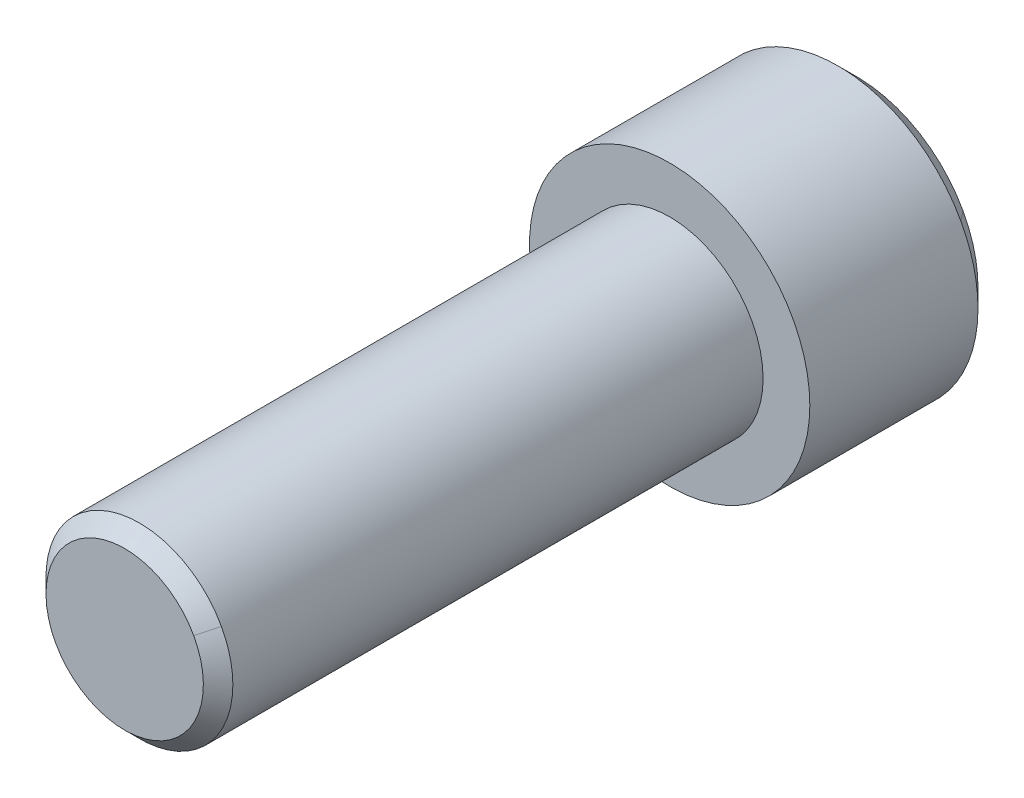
ISO-10303-21;
HEADER;
FILE_DESCRIPTION(('STEP AP214'),'2;1');
FILE_NAME('part.step','',(''),(''),'','','');
FILE_SCHEMA(('AUTOMOTIVE_DESIGN { 1 0 10303 214 1 1 1 1 }'));
ENDSEC;
DATA;
#1=APPLICATION_CONTEXT('core data for automotive mechanical design processes');
#2=APPLICATION_PROTOCOL_DEFINITION('international standard','automotive_design',2000,#1);
#3=PRODUCT_CONTEXT('',#1,'mechanical');
#4=PRODUCT('Part','Part','',(#3));
#5=PRODUCT_RELATED_PRODUCT_CATEGORY('part','',(#4));
#6=PRODUCT_DEFINITION_FORMATION('','',#4);
#7=PRODUCT_DEFINITION_CONTEXT('part definition',#1,'design');
#8=PRODUCT_DEFINITION('design','',#6,#7);
#9=PRODUCT_DEFINITION_SHAPE('','',#8);
#10=(LENGTH_UNIT() NAMED_UNIT(*) SI_UNIT(.MILLI.,.METRE.));
#11=(NAMED_UNIT(*) PLANE_ANGLE_UNIT() SI_UNIT($,.RADIAN.));
#12=(NAMED_UNIT(*) SI_UNIT($,.STERADIAN.) SOLID_ANGLE_UNIT());
#13=UNCERTAINTY_MEASURE_WITH_UNIT(LENGTH_MEASURE(1.E-05),#10,'distance_accuracy_value','');
#14=(GEOMETRIC_REPRESENTATION_CONTEXT(3) GLOBAL_UNCERTAINTY_ASSIGNED_CONTEXT((#13)) GLOBAL_UNIT_ASSIGNED_CONTEXT((#10,
#11,#12)) REPRESENTATION_CONTEXT('',''));
#15=CARTESIAN_POINT('',(0.,0.,0.));
#16=DIRECTION('',(0.,0.,1.));
#17=DIRECTION('',(1.,0.,0.));
#18=AXIS2_PLACEMENT_3D('',#15,#16,#17);
#19=CARTESIAN_POINT('',(0.,0.,6.00000000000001));
#20=DIRECTION('',(0.,0.,-1.));
#21=DIRECTION('',(-1.,0.,0.));
#22=AXIS2_PLACEMENT_3D('',#19,#20,#21);
#23=PLANE('',#22);
#24=DIRECTION('',(0.50000000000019,-0.866025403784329,0.));
#25=VECTOR('',#24,1.);
#26=CARTESIAN_POINT('',(2.88675134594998,5.,6.00000000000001));
#27=LINE('',#26,#25);
#28=CARTESIAN_POINT('',(5.77350269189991,0.,6.00000000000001));
#29=VERTEX_POINT('',#28);
#30=CARTESIAN_POINT('',(2.88675134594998,5.,6.00000000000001));
#31=VERTEX_POINT('',#30);
#32=EDGE_CURVE('E111',#29,#31,#27,.F.);
#33=ORIENTED_EDGE('',*,*,#32,.F.);
#34=DIRECTION('',(-0.50000000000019,-0.866025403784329,0.));
#35=VECTOR('',#34,1.);
#36=CARTESIAN_POINT('',(5.77350269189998,0.,6.00000000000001));
#37=LINE('',#36,#35);
#38=CARTESIAN_POINT('',(2.88675134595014,-5.0000000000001,6.00000000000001));
#39=VERTEX_POINT('',#38);
#40=EDGE_CURVE('E92',#39,#29,#37,.F.);
#41=ORIENTED_EDGE('',*,*,#40,.F.);
#42=DIRECTION('',(-1.,0.,0.));
#43=VECTOR('',#42,1.);
#44=CARTESIAN_POINT('',(2.88675134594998,-5.00000000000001,6.00000000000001));
#45=LINE('',#44,#43);
#46=CARTESIAN_POINT('',(-2.88675134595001,-5.00000000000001,6.00000000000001));
#47=VERTEX_POINT('',#46);
#48=EDGE_CURVE('E108',#47,#39,#45,.F.);
#49=ORIENTED_EDGE('',*,*,#48,.F.);
#50=DIRECTION('',(-0.50000000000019,0.866025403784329,0.));
#51=VECTOR('',#50,1.);
#52=CARTESIAN_POINT('',(-2.88675134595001,-5.00000000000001,6.00000000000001));
#53=LINE('',#52,#51);
#54=CARTESIAN_POINT('',(-5.77350269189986,0.,6.00000000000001));
#55=VERTEX_POINT('',#54);
#56=EDGE_CURVE('E126',#55,#47,#53,.F.);
#57=ORIENTED_EDGE('',*,*,#56,.F.);
#58=DIRECTION('',(0.50000000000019,0.866025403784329,0.));
#59=VECTOR('',#58,1.);
#60=CARTESIAN_POINT('',(-5.77350269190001,0.,6.00000000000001));
#61=LINE('',#60,#59);
#62=CARTESIAN_POINT('',(-2.88675134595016,5.00000000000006,6.00000000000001));
#63=VERTEX_POINT('',#62);
#64=EDGE_CURVE('E131',#63,#55,#61,.F.);
#65=ORIENTED_EDGE('',*,*,#64,.F.);
#66=DIRECTION('',(1.,0.,0.));
#67=VECTOR('',#66,1.);
#68=CARTESIAN_POINT('',(-2.88675134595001,4.99999999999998,6.00000000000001));
#69=LINE('',#68,#67);
#70=EDGE_CURVE('E137',#31,#63,#69,.F.);
#71=ORIENTED_EDGE('',*,*,#70,.F.);
#72=EDGE_LOOP('',(#33,#41,#49,#57,#65,#71));
#73=FACE_BOUND('',#72,.T.);
#74=ADVANCED_FACE('F16',(#73),#23,.T.);
#75=CARTESIAN_POINT('',(5.77350269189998,0.,0.));
#76=DIRECTION('',(-0.866025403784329,0.50000000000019,0.));
#77=DIRECTION('',(-0.50000000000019,-0.866025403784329,0.));
#78=AXIS2_PLACEMENT_3D('',#75,#76,#77);
#79=PLANE('',#78);
#80=DIRECTION('',(0.,0.,1.));
#81=VECTOR('',#80,1.);
#82=CARTESIAN_POINT('',(2.88675134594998,-5.00000000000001,0.));
#83=LINE('',#82,#81);
#84=CARTESIAN_POINT('',(2.88675134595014,-5.0000000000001,0.));
#85=VERTEX_POINT('',#84);
#86=EDGE_CURVE('E112',#39,#85,#83,.F.);
#87=ORIENTED_EDGE('',*,*,#86,.F.);
#88=ORIENTED_EDGE('',*,*,#40,.T.);
#89=DIRECTION('',(0.,0.,1.));
#90=VECTOR('',#89,1.);
#91=CARTESIAN_POINT('',(5.77350269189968,-1.80411241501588E-13,0.));
#92=LINE('',#91,#90);
#93=CARTESIAN_POINT('',(5.77350269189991,0.,0.));
#94=VERTEX_POINT('',#93);
#95=EDGE_CURVE('E88',#94,#29,#92,.T.);
#96=ORIENTED_EDGE('',*,*,#95,.F.);
#97=DIRECTION('',(-0.500000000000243,-0.866025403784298,0.));
#98=VECTOR('',#97,1.);
#99=CARTESIAN_POINT('',(5.77350269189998,0.,0.));
#100=LINE('',#99,#98);
#101=EDGE_CURVE('E117',#94,#85,#100,.T.);
#102=ORIENTED_EDGE('',*,*,#101,.T.);
#103=EDGE_LOOP('',(#87,#88,#96,#102));
#104=FACE_BOUND('',#103,.T.);
#105=ADVANCED_FACE('F115',(#104),#79,.T.);
#106=CARTESIAN_POINT('',(2.88675134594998,-5.00000000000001,0.));
#107=DIRECTION('',(0.,1.,0.));
#108=DIRECTION('',(-1.,0.,0.));
#109=AXIS2_PLACEMENT_3D('',#106,#107,#108);
#110=PLANE('',#109);
#111=DIRECTION('',(0.,0.,1.));
#112=VECTOR('',#111,1.);
#113=CARTESIAN_POINT('',(-2.88675134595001,-5.00000000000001,0.));
#114=LINE('',#113,#112);
#115=CARTESIAN_POINT('',(-2.88675134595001,-5.00000000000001,0.));
#116=VERTEX_POINT('',#115);
#117=EDGE_CURVE('E123',#47,#116,#114,.F.);
#118=ORIENTED_EDGE('',*,*,#117,.F.);
#119=ORIENTED_EDGE('',*,*,#48,.T.);
#120=ORIENTED_EDGE('',*,*,#86,.T.);
#121=DIRECTION('',(1.,0.,0.));
#122=VECTOR('',#121,1.);
#123=CARTESIAN_POINT('',(0.,-5.00000000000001,0.));
#124=LINE('',#123,#122);
#125=EDGE_CURVE('E152',#85,#116,#124,.F.);
#126=ORIENTED_EDGE('',*,*,#125,.T.);
#127=EDGE_LOOP('',(#118,#119,#120,#126));
#128=FACE_BOUND('',#127,.T.);
#129=ADVANCED_FACE('F121',(#128),#110,.T.);
#130=CARTESIAN_POINT('',(-2.88675134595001,-5.00000000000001,0.));
#131=DIRECTION('',(0.866025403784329,0.50000000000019,0.));
#132=DIRECTION('',(-0.50000000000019,0.866025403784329,0.));
#133=AXIS2_PLACEMENT_3D('',#130,#131,#132);
#134=PLANE('',#133);
#135=DIRECTION('',(0.,0.,1.));
#136=VECTOR('',#135,1.);
#137=CARTESIAN_POINT('',(-5.77350269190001,0.,0.));
#138=LINE('',#137,#136);
#139=CARTESIAN_POINT('',(-5.77350269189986,0.,0.));
#140=VERTEX_POINT('',#139);
#141=EDGE_CURVE('E129',#55,#140,#138,.F.);
#142=ORIENTED_EDGE('',*,*,#141,.F.);
#143=ORIENTED_EDGE('',*,*,#56,.T.);
#144=ORIENTED_EDGE('',*,*,#117,.T.);
#145=DIRECTION('',(-0.500000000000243,0.866025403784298,0.));
#146=VECTOR('',#145,1.);
#147=CARTESIAN_POINT('',(-2.88675134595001,-5.00000000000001,0.));
#148=LINE('',#147,#146);
#149=EDGE_CURVE('E150',#116,#140,#148,.T.);
#150=ORIENTED_EDGE('',*,*,#149,.T.);
#151=EDGE_LOOP('',(#142,#143,#144,#150));
#152=FACE_BOUND('',#151,.T.);
#153=ADVANCED_FACE('F273',(#152),#134,.T.);
#154=CARTESIAN_POINT('',(-5.77350269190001,0.,0.));
#155=DIRECTION('',(0.866025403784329,-0.50000000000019,0.));
#156=DIRECTION('',(0.50000000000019,0.866025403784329,0.));
#157=AXIS2_PLACEMENT_3D('',#154,#155,#156);
#158=PLANE('',#157);
#159=DIRECTION('',(0.,0.,-1.));
#160=VECTOR('',#159,1.);
#161=CARTESIAN_POINT('',(-2.88675134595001,4.99999999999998,0.));
#162=LINE('',#161,#160);
#163=CARTESIAN_POINT('',(-2.88675134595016,5.00000000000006,0.));
#164=VERTEX_POINT('',#163);
#165=EDGE_CURVE('E134',#63,#164,#162,.T.);
#166=ORIENTED_EDGE('',*,*,#165,.F.);
#167=ORIENTED_EDGE('',*,*,#64,.T.);
#168=ORIENTED_EDGE('',*,*,#141,.T.);
#169=DIRECTION('',(0.500000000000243,0.866025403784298,0.));
#170=VECTOR('',#169,1.);
#171=CARTESIAN_POINT('',(-5.77350269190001,0.,0.));
#172=LINE('',#171,#170);
#173=EDGE_CURVE('E148',#140,#164,#172,.T.);
#174=ORIENTED_EDGE('',*,*,#173,.T.);
#175=EDGE_LOOP('',(#166,#167,#168,#174));
#176=FACE_BOUND('',#175,.T.);
#177=ADVANCED_FACE('F270',(#176),#158,.T.);
#178=CARTESIAN_POINT('',(-2.88675134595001,4.99999999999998,0.));
#179=DIRECTION('',(0.,-1.,0.));
#180=DIRECTION('',(0.,0.,-1.));
#181=AXIS2_PLACEMENT_3D('',#178,#179,#180);
#182=PLANE('',#181);
#183=DIRECTION('',(0.,0.,1.));
#184=VECTOR('',#183,1.);
#185=CARTESIAN_POINT('',(2.88675134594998,5.,0.));
#186=LINE('',#185,#184);
#187=CARTESIAN_POINT('',(2.88675134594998,5.,0.));
#188=VERTEX_POINT('',#187);
#189=EDGE_CURVE('E140',#31,#188,#186,.F.);
#190=ORIENTED_EDGE('',*,*,#189,.F.);
#191=ORIENTED_EDGE('',*,*,#70,.T.);
#192=ORIENTED_EDGE('',*,*,#165,.T.);
#193=DIRECTION('',(1.,0.,0.));
#194=VECTOR('',#193,1.);
#195=CARTESIAN_POINT('',(0.,5.,0.));
#196=LINE('',#195,#194);
#197=EDGE_CURVE('E68',#164,#188,#196,.T.);
#198=ORIENTED_EDGE('',*,*,#197,.T.);
#199=EDGE_LOOP('',(#190,#191,#192,#198));
#200=FACE_BOUND('',#199,.T.);
#201=ADVANCED_FACE('F264',(#200),#182,.T.);
#202=CARTESIAN_POINT('',(2.88675134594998,5.,0.));
#203=DIRECTION('',(-0.866025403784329,-0.50000000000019,0.));
#204=DIRECTION('',(0.50000000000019,-0.866025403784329,0.));
#205=AXIS2_PLACEMENT_3D('',#202,#203,#204);
#206=PLANE('',#205);
#207=ORIENTED_EDGE('',*,*,#95,.T.);
#208=ORIENTED_EDGE('',*,*,#32,.T.);
#209=ORIENTED_EDGE('',*,*,#189,.T.);
#210=DIRECTION('',(0.500000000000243,-0.866025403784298,0.));
#211=VECTOR('',#210,1.);
#212=CARTESIAN_POINT('',(2.88675134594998,5.,0.));
#213=LINE('',#212,#211);
#214=EDGE_CURVE('E145',#188,#94,#213,.T.);
#215=ORIENTED_EDGE('',*,*,#214,.T.);
#216=EDGE_LOOP('',(#207,#208,#209,#215));
#217=FACE_BOUND('',#216,.T.);
#218=ADVANCED_FACE('F259',(#217),#206,.T.);
#219=CARTESIAN_POINT('',(0.,0.,0.));
#220=DIRECTION('',(0.,0.,1.));
#221=DIRECTION('',(1.,0.,0.));
#222=AXIS2_PLACEMENT_3D('',#219,#220,#221);
#223=PLANE('',#222);
#224=ORIENTED_EDGE('',*,*,#197,.F.);
#225=ORIENTED_EDGE('',*,*,#173,.F.);
#226=ORIENTED_EDGE('',*,*,#149,.F.);
#227=ORIENTED_EDGE('',*,*,#125,.F.);
#228=ORIENTED_EDGE('',*,*,#101,.F.);
#229=ORIENTED_EDGE('',*,*,#214,.F.);
#230=EDGE_LOOP('',(#224,#225,#226,#227,#228,#229));
#231=FACE_BOUND('',#230,.T.);
#232=CARTESIAN_POINT('',(0.,0.,0.));
#233=DIRECTION('',(0.,0.,1.));
#234=DIRECTION('',(0.,-1.,0.));
#235=AXIS2_PLACEMENT_3D('',#232,#233,#234);
#236=CIRCLE('',#235,7.80000000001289);
#237=CARTESIAN_POINT('',(6.84514398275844,3.73951920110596,1.80411241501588E-13));
#238=VERTEX_POINT('',#237);
#239=CARTESIAN_POINT('',(-6.84514389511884,-3.7395193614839,1.80411241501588E-13));
#240=VERTEX_POINT('',#239);
#241=EDGE_CURVE('E188',#238,#240,#236,.T.);
#242=ORIENTED_EDGE('',*,*,#241,.F.);
#243=CARTESIAN_POINT('',(0.,0.,3.60822483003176E-13));
#244=DIRECTION('',(0.,0.,1.));
#245=DIRECTION('',(1.,0.,0.));
#246=AXIS2_PLACEMENT_3D('',#243,#244,#245);
#247=CIRCLE('',#246,7.80000000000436);
#248=EDGE_CURVE('E20',#240,#238,#247,.T.);
#249=ORIENTED_EDGE('',*,*,#248,.F.);
#250=EDGE_LOOP('',(#242,#249));
#251=FACE_BOUND('',#250,.T.);
#252=ADVANCED_FACE('F255',(#231,#251),#223,.F.);
#253=CARTESIAN_POINT('',(0.,0.,1.19999999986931));
#254=DIRECTION('',(0.,0.,1.));
#255=DIRECTION('',(1.,0.,0.));
#256=AXIS2_PLACEMENT_3D('',#253,#254,#255);
#257=CONICAL_SURFACE('',#256,8.99999999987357,0.785398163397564);
#258=DIRECTION('',(-0.620544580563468,-0.339005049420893,-0.707106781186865));
#259=VECTOR('',#258,1.);
#260=CARTESIAN_POINT('',(437920.543526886,239237.083282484,499000.));
#261=LINE('',#260,#259);
#262=CARTESIAN_POINT('',(7.89824305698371,4.31482984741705,1.19999999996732));
#263=VERTEX_POINT('',#262);
#264=EDGE_CURVE('E190',#263,#238,#261,.T.);
#265=ORIENTED_EDGE('',*,*,#264,.F.);
#266=CARTESIAN_POINT('',(0.,0.,1.19999999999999));
#267=DIRECTION('',(0.,0.,1.));
#268=DIRECTION('',(1.,0.,0.));
#269=AXIS2_PLACEMENT_3D('',#266,#267,#268);
#270=CIRCLE('',#269,9.);
#271=CARTESIAN_POINT('',(-7.89824305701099,-4.31482984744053,1.20000000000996));
#272=VERTEX_POINT('',#271);
#273=EDGE_CURVE('E187',#272,#263,#270,.T.);
#274=ORIENTED_EDGE('',*,*,#273,.F.);
#275=CARTESIAN_POINT('',(-6.84514389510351,-3.73951936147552,0.));
#276=CARTESIAN_POINT('',(-6.8890230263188,-3.76349063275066,0.0499999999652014));
#277=CARTESIAN_POINT('',(-6.93290215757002,-3.78746190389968,0.0999999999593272));
#278=CARTESIAN_POINT('',(-7.02066042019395,-3.83540444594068,0.199999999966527));
#279=CARTESIAN_POINT('',(-7.06453955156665,-3.85937571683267,0.2499999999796));
#280=CARTESIAN_POINT('',(-7.15229781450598,-3.90731825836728,0.350000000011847));
#281=CARTESIAN_POINT('',(-7.19617694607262,-3.9312895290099,0.400000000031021));
#282=CARTESIAN_POINT('',(-7.28393520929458,-3.97923207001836,0.500000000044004));
#283=CARTESIAN_POINT('',(-7.3278143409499,-4.00320334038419,0.550000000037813));
#284=CARTESIAN_POINT('',(-7.41557260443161,-4.05114588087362,0.650000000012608));
#285=CARTESIAN_POINT('',(-7.45945173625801,-4.07511715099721,0.699999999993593));
#286=CARTESIAN_POINT('',(-7.54721000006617,-4.12305969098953,0.800000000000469));
#287=CARTESIAN_POINT('',(-7.59108913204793,-4.14703096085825,0.85000000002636));
#288=CARTESIAN_POINT('',(-7.67884739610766,-4.1949735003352,0.950000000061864));
#289=CARTESIAN_POINT('',(-7.72272652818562,-4.21894476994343,1.00000000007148));
#290=CARTESIAN_POINT('',(-7.81048479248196,-4.26688730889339,1.10000000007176));
#291=CARTESIAN_POINT('',(-7.85436392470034,-4.29085857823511,1.15000000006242));
#292=CARTESIAN_POINT('',(-7.8982430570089,-4.31482984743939,1.20000000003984));
#293=B_SPLINE_CURVE_WITH_KNOTS('',3,(#275,#276,#277,#278,#279,#280,#281,#282,#283,#284,#285,
#286,#287,#288,#289,#290,#291,#292),.UNSPECIFIED.,.F.,.F.,(4,2,2,2,2,2,2,2,4),(0.,
0.212132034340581,0.424264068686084,0.636396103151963,0.848528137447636,1.06066017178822,
1.2727922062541,1.4849242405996,1.69705627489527),.UNSPECIFIED.);
#294=EDGE_CURVE('E170',#240,#272,#293,.T.);
#295=ORIENTED_EDGE('',*,*,#294,.F.);
#296=ORIENTED_EDGE('',*,*,#248,.T.);
#297=EDGE_LOOP('',(#265,#274,#295,#296));
#298=FACE_BOUND('',#297,.T.);
#299=ADVANCED_FACE('F162',(#298),#257,.T.);
#300=CARTESIAN_POINT('',(0.,0.,1.19999999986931));
#301=DIRECTION('',(0.,0.,1.));
#302=DIRECTION('',(0.,-1.,0.));
#303=AXIS2_PLACEMENT_3D('',#300,#301,#302);
#304=CONICAL_SURFACE('',#303,8.99999999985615,0.785398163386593);
#305=ORIENTED_EDGE('',*,*,#294,.T.);
#306=CARTESIAN_POINT('',(0.,0.,1.19999999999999));
#307=DIRECTION('',(0.,0.,1.));
#308=DIRECTION('',(1.,0.,0.));
#309=AXIS2_PLACEMENT_3D('',#306,#307,#308);
#310=CIRCLE('',#309,9.);
#311=EDGE_CURVE('E200',#263,#272,#310,.T.);
#312=ORIENTED_EDGE('',*,*,#311,.F.);
#313=ORIENTED_EDGE('',*,*,#264,.T.);
#314=ORIENTED_EDGE('',*,*,#241,.T.);
#315=EDGE_LOOP('',(#305,#312,#313,#314));
#316=FACE_BOUND('',#315,.T.);
#317=ADVANCED_FACE('F164',(#316),#304,.T.);
#318=CARTESIAN_POINT('',(5.05300000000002,0.,47.));
#319=DIRECTION('',(0.,0.,1.));
#320=DIRECTION('',(1.,0.,0.));
#321=AXIS2_PLACEMENT_3D('',#318,#319,#320);
#322=PLANE('',#321);
#323=CARTESIAN_POINT('',(0.,0.,47.0000000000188));
#324=DIRECTION('',(0.,0.,-1.));
#325=DIRECTION('',(-1.,0.,0.));
#326=AXIS2_PLACEMENT_3D('',#323,#324,#325);
#327=CIRCLE('',#326,5.05299999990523);
#328=CARTESIAN_POINT('',(4.43442468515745,2.42253724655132,47.0000000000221));
#329=VERTEX_POINT('',#328);
#330=CARTESIAN_POINT('',(-4.43442468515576,-2.42253724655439,46.9999999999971));
#331=VERTEX_POINT('',#330);
#332=EDGE_CURVE('E181',#329,#331,#327,.T.);
#333=ORIENTED_EDGE('',*,*,#332,.F.);
#334=CARTESIAN_POINT('',(0.,0.,47.0000000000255));
#335=DIRECTION('',(0.,0.,-1.));
#336=DIRECTION('',(-1.,0.,0.));
#337=AXIS2_PLACEMENT_3D('',#334,#335,#336);
#338=CIRCLE('',#337,5.05299999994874);
#339=EDGE_CURVE('E186',#331,#329,#338,.T.);
#340=ORIENTED_EDGE('',*,*,#339,.F.);
#341=EDGE_LOOP('',(#333,#340));
#342=FACE_BOUND('',#341,.T.);
#343=ADVANCED_FACE('F226',(#342),#322,.T.);
#344=CARTESIAN_POINT('',(0.,0.,46.0529999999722));
#345=DIRECTION('',(0.,0.,-1.));
#346=DIRECTION('',(-1.,0.,0.));
#347=AXIS2_PLACEMENT_3D('',#344,#345,#346);
#348=CONICAL_SURFACE('',#347,5.99999999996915,0.78539816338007);
#349=DIRECTION('',(-0.620544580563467,-0.339005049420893,0.707106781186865));
#350=VECTOR('',#349,1.);
#351=CARTESIAN_POINT('',(437959.379187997,239258.299300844,-499000.));
#352=LINE('',#351,#350);
#353=CARTESIAN_POINT('',(5.26549537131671,2.87655323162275,46.0530000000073));
#354=VERTEX_POINT('',#353);
#355=EDGE_CURVE('E185',#354,#329,#352,.T.);
#356=ORIENTED_EDGE('',*,*,#355,.F.);
#357=CARTESIAN_POINT('',(0.,0.,46.053));
#358=DIRECTION('',(0.,0.,1.));
#359=DIRECTION('',(1.,0.,0.));
#360=AXIS2_PLACEMENT_3D('',#357,#358,#359);
#361=CIRCLE('',#360,6.);
#362=CARTESIAN_POINT('',(-5.26549537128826,-2.87655323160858,46.0530000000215));
#363=VERTEX_POINT('',#362);
#364=EDGE_CURVE('E35',#363,#354,#361,.F.);
#365=ORIENTED_EDGE('',*,*,#364,.F.);
#366=DIRECTION('',(0.620544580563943,0.339005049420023,0.707106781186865));
#367=VECTOR('',#366,1.);
#368=CARTESIAN_POINT('',(-437959.379188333,-239258.299300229,-499000.));
#369=LINE('',#368,#367);
#370=EDGE_CURVE('E184',#331,#363,#369,.F.);
#371=ORIENTED_EDGE('',*,*,#370,.F.);
#372=ORIENTED_EDGE('',*,*,#339,.T.);
#373=EDGE_LOOP('',(#356,#365,#371,#372));
#374=FACE_BOUND('',#373,.T.);
#375=ADVANCED_FACE('F224',(#374),#348,.T.);
#376=CARTESIAN_POINT('',(0.,0.,23.5));
#377=DIRECTION('',(0.,0.,1.));
#378=DIRECTION('',(1.,0.,0.));
#379=AXIS2_PLACEMENT_3D('',#376,#377,#378);
#380=CYLINDRICAL_SURFACE('',#379,9.);
#381=CARTESIAN_POINT('',(0.,0.,12.));
#382=DIRECTION('',(0.,0.,1.));
#383=DIRECTION('',(1.,0.,0.));
#384=AXIS2_PLACEMENT_3D('',#381,#382,#383);
#385=CIRCLE('',#384,9.);
#386=CARTESIAN_POINT('',(8.99999999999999,0.,12.));
#387=VERTEX_POINT('',#386);
#388=EDGE_CURVE('E178',#387,#387,#385,.T.);
#389=ORIENTED_EDGE('',*,*,#388,.F.);
#390=EDGE_LOOP('',(#389));
#391=FACE_BOUND('',#390,.T.);
#392=ORIENTED_EDGE('',*,*,#311,.T.);
#393=ORIENTED_EDGE('',*,*,#273,.T.);
#394=EDGE_LOOP('',(#392,#393));
#395=FACE_BOUND('',#394,.T.);
#396=ADVANCED_FACE('F233',(#391,#395),#380,.T.);
#397=CARTESIAN_POINT('',(0.,0.,46.0529999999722));
#398=DIRECTION('',(0.,0.,-1.));
#399=DIRECTION('',(-1.,0.,0.));
#400=AXIS2_PLACEMENT_3D('',#397,#398,#399);
#401=CONICAL_SURFACE('',#400,5.99999999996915,0.785398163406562);
#402=ORIENTED_EDGE('',*,*,#370,.T.);
#403=CARTESIAN_POINT('',(0.,0.,46.053));
#404=DIRECTION('',(0.,0.,1.));
#405=DIRECTION('',(1.,0.,0.));
#406=AXIS2_PLACEMENT_3D('',#403,#404,#405);
#407=CIRCLE('',#406,6.);
#408=EDGE_CURVE('E26',#354,#363,#407,.F.);
#409=ORIENTED_EDGE('',*,*,#408,.F.);
#410=ORIENTED_EDGE('',*,*,#355,.T.);
#411=ORIENTED_EDGE('',*,*,#332,.T.);
#412=EDGE_LOOP('',(#402,#409,#410,#411));
#413=FACE_BOUND('',#412,.T.);
#414=ADVANCED_FACE('F222',(#413),#401,.T.);
#415=CARTESIAN_POINT('',(8.99999999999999,0.,12.));
#416=DIRECTION('',(0.,0.,1.));
#417=DIRECTION('',(1.,0.,0.));
#418=AXIS2_PLACEMENT_3D('',#415,#416,#417);
#419=PLANE('',#418);
#420=CARTESIAN_POINT('',(0.,0.,12.));
#421=DIRECTION('',(0.,0.,1.));
#422=DIRECTION('',(1.,0.,0.));
#423=AXIS2_PLACEMENT_3D('',#420,#421,#422);
#424=CIRCLE('',#423,6.);
#425=CARTESIAN_POINT('',(5.99999999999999,0.,12.));
#426=VERTEX_POINT('',#425);
#427=EDGE_CURVE('E11',#426,#426,#424,.T.);
#428=ORIENTED_EDGE('',*,*,#427,.F.);
#429=EDGE_LOOP('',(#428));
#430=FACE_BOUND('',#429,.T.);
#431=ORIENTED_EDGE('',*,*,#388,.T.);
#432=EDGE_LOOP('',(#431));
#433=FACE_BOUND('',#432,.T.);
#434=ADVANCED_FACE('F236',(#430,#433),#419,.T.);
#435=CARTESIAN_POINT('',(0.,0.,23.5));
#436=DIRECTION('',(0.,0.,1.));
#437=DIRECTION('',(1.,0.,0.));
#438=AXIS2_PLACEMENT_3D('',#435,#436,#437);
#439=CYLINDRICAL_SURFACE('',#438,6.);
#440=ORIENTED_EDGE('',*,*,#364,.T.);
#441=ORIENTED_EDGE('',*,*,#408,.T.);
#442=EDGE_LOOP('',(#440,#441));
#443=FACE_BOUND('',#442,.T.);
#444=ORIENTED_EDGE('',*,*,#427,.T.);
#445=EDGE_LOOP('',(#444));
#446=FACE_BOUND('',#445,.T.);
#447=ADVANCED_FACE('F18',(#443,#446),#439,.T.);
#448=CLOSED_SHELL('',(#74,#105,#129,#153,#177,#201,#218,#252,#299,#317,#343,#375,#396,#414,#434,#447));
#449=MANIFOLD_SOLID_BREP('B1',#448);
#450=ADVANCED_BREP_SHAPE_REPRESENTATION('',(#18,#449),#14);
#451=SHAPE_DEFINITION_REPRESENTATION(#9,#450);
ENDSEC;
END-ISO-10303-21;
